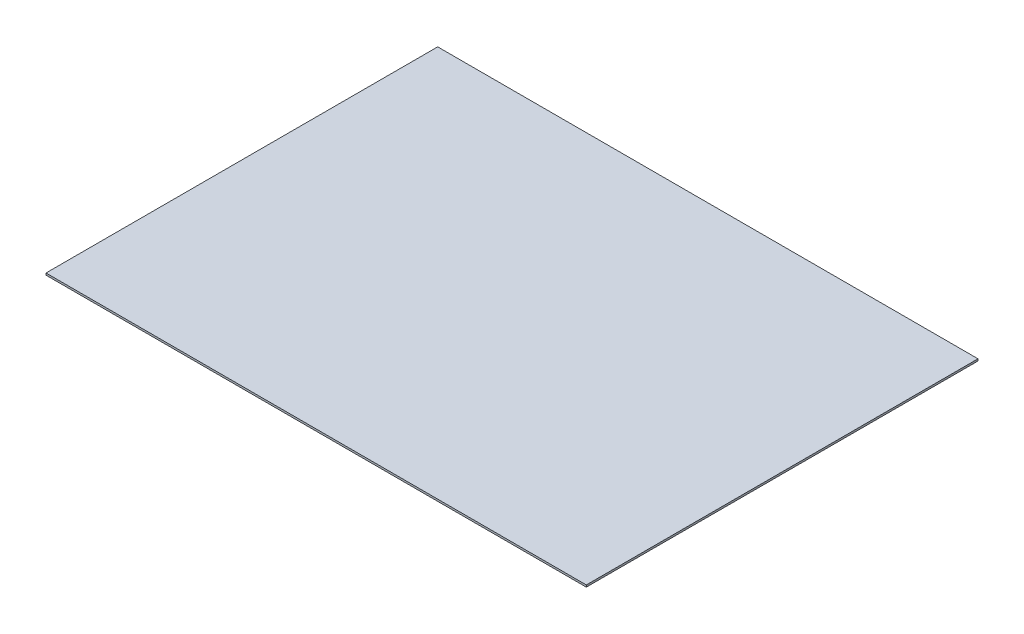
from build123d import *

# Parameters (mm, degrees)
CROQUIS1_W     = 698
CROQUIS1_H     = 2.5
EXTRUIR1_DEPTH = 253


with BuildPart() as part:
    # Croquis1 → Extruir1 (new, symmetric)
    with BuildSketch(Plane.XY):
        Rectangle(CROQUIS1_W, CROQUIS1_H)
    extrude(amount=EXTRUIR1_DEPTH, both=True)


solid = part.part
